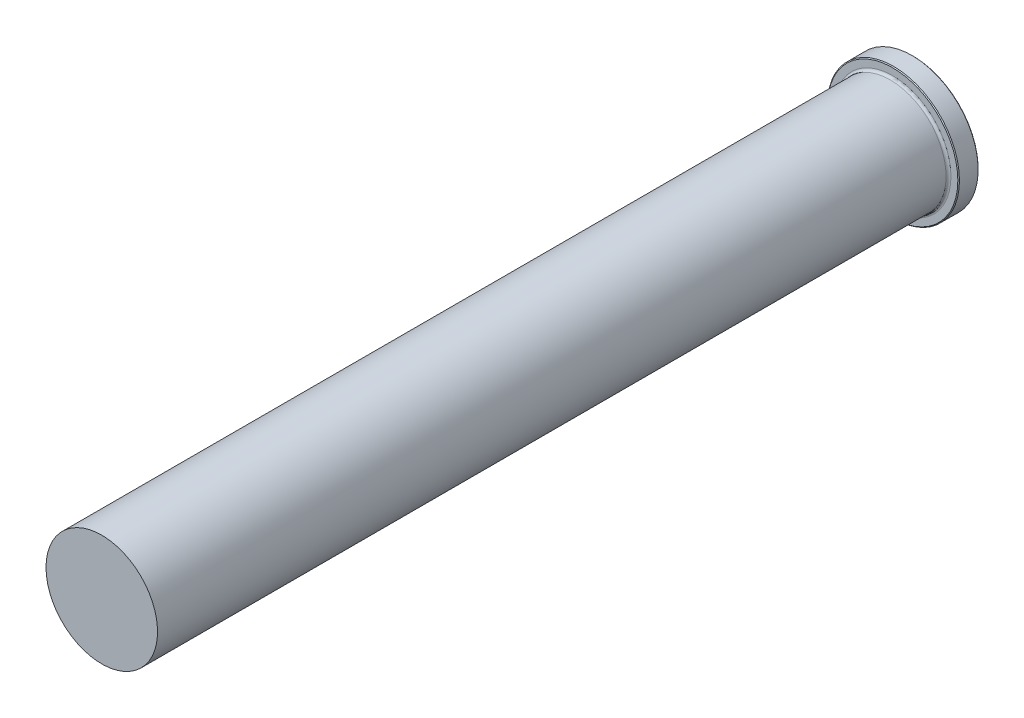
ISO-10303-21;
HEADER;
FILE_DESCRIPTION(('STEP AP214'),'2;1');
FILE_NAME('part.step','',(''),(''),'','','');
FILE_SCHEMA(('AUTOMOTIVE_DESIGN { 1 0 10303 214 1 1 1 1 }'));
ENDSEC;
DATA;
#1=APPLICATION_CONTEXT('core data for automotive mechanical design processes');
#2=APPLICATION_PROTOCOL_DEFINITION('international standard','automotive_design',2000,#1);
#3=PRODUCT_CONTEXT('',#1,'mechanical');
#4=PRODUCT('Part','Part','',(#3));
#5=PRODUCT_RELATED_PRODUCT_CATEGORY('part','',(#4));
#6=PRODUCT_DEFINITION_FORMATION('','',#4);
#7=PRODUCT_DEFINITION_CONTEXT('part definition',#1,'design');
#8=PRODUCT_DEFINITION('design','',#6,#7);
#9=PRODUCT_DEFINITION_SHAPE('','',#8);
#10=(LENGTH_UNIT() NAMED_UNIT(*) SI_UNIT(.MILLI.,.METRE.));
#11=(NAMED_UNIT(*) PLANE_ANGLE_UNIT() SI_UNIT($,.RADIAN.));
#12=(NAMED_UNIT(*) SI_UNIT($,.STERADIAN.) SOLID_ANGLE_UNIT());
#13=UNCERTAINTY_MEASURE_WITH_UNIT(LENGTH_MEASURE(1.E-05),#10,'distance_accuracy_value','');
#14=(GEOMETRIC_REPRESENTATION_CONTEXT(3) GLOBAL_UNCERTAINTY_ASSIGNED_CONTEXT((#13)) GLOBAL_UNIT_ASSIGNED_CONTEXT((#10,
#11,#12)) REPRESENTATION_CONTEXT('',''));
#15=CARTESIAN_POINT('',(0.,0.,0.));
#16=DIRECTION('',(0.,0.,1.));
#17=DIRECTION('',(1.,0.,0.));
#18=AXIS2_PLACEMENT_3D('',#15,#16,#17);
#19=CARTESIAN_POINT('',(0.,0.,0.));
#20=DIRECTION('',(0.,0.,-1.));
#21=DIRECTION('',(-1.,0.,0.));
#22=AXIS2_PLACEMENT_3D('',#19,#20,#21);
#23=PLANE('',#22);
#24=CARTESIAN_POINT('',(0.,0.,0.));
#25=DIRECTION('',(0.,0.,-1.));
#26=DIRECTION('',(-1.,0.,0.));
#27=AXIS2_PLACEMENT_3D('',#24,#25,#26);
#28=CIRCLE('',#27,20.3835);
#29=CARTESIAN_POINT('',(-20.3835,0.,0.));
#30=VERTEX_POINT('',#29);
#31=EDGE_CURVE('E50',#30,#30,#28,.T.);
#32=ORIENTED_EDGE('',*,*,#31,.T.);
#33=EDGE_LOOP('',(#32));
#34=FACE_BOUND('',#33,.T.);
#35=ADVANCED_FACE('F35',(#34),#23,.T.);
#36=CARTESIAN_POINT('',(0.,0.,0.));
#37=DIRECTION('',(0.,0.,-1.));
#38=DIRECTION('',(-1.,0.,0.));
#39=AXIS2_PLACEMENT_3D('',#36,#37,#38);
#40=CYLINDRICAL_SURFACE('',#39,20.6375);
#41=CARTESIAN_POINT('',(0.,0.,0.254000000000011));
#42=DIRECTION('',(0.,0.,-1.));
#43=DIRECTION('',(-1.,0.,0.));
#44=AXIS2_PLACEMENT_3D('',#41,#42,#43);
#45=CIRCLE('',#44,20.6375);
#46=CARTESIAN_POINT('',(-20.6375,0.,0.254000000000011));
#47=VERTEX_POINT('',#46);
#48=EDGE_CURVE('E42',#47,#47,#45,.F.);
#49=ORIENTED_EDGE('',*,*,#48,.T.);
#50=EDGE_LOOP('',(#49));
#51=FACE_BOUND('',#50,.T.);
#52=CARTESIAN_POINT('',(0.,0.,6.09600000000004));
#53=DIRECTION('',(0.,0.,1.));
#54=DIRECTION('',(1.,0.,0.));
#55=AXIS2_PLACEMENT_3D('',#52,#53,#54);
#56=CIRCLE('',#55,20.6375);
#57=CARTESIAN_POINT('',(20.6375,0.,6.09600000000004));
#58=VERTEX_POINT('',#57);
#59=EDGE_CURVE('E46',#58,#58,#56,.F.);
#60=ORIENTED_EDGE('',*,*,#59,.T.);
#61=EDGE_LOOP('',(#60));
#62=FACE_BOUND('',#61,.T.);
#63=ADVANCED_FACE('F82',(#51,#62),#40,.T.);
#64=CARTESIAN_POINT('',(0.,20.6375,6.35));
#65=DIRECTION('',(0.,0.,1.));
#66=DIRECTION('',(1.,0.,0.));
#67=AXIS2_PLACEMENT_3D('',#64,#65,#66);
#68=PLANE('',#67);
#69=CARTESIAN_POINT('',(0.,0.,6.35));
#70=DIRECTION('',(0.,0.,1.));
#71=DIRECTION('',(1.,0.,0.));
#72=AXIS2_PLACEMENT_3D('',#69,#70,#71);
#73=CIRCLE('',#72,20.3835);
#74=CARTESIAN_POINT('',(20.3835,0.,6.35));
#75=VERTEX_POINT('',#74);
#76=EDGE_CURVE('E10',#75,#75,#73,.T.);
#77=ORIENTED_EDGE('',*,*,#76,.T.);
#78=EDGE_LOOP('',(#77));
#79=FACE_BOUND('',#78,.T.);
#80=CARTESIAN_POINT('',(0.,0.,6.35));
#81=DIRECTION('',(0.,0.,1.));
#82=DIRECTION('',(1.,0.,0.));
#83=AXIS2_PLACEMENT_3D('',#80,#81,#82);
#84=CIRCLE('',#83,18.2245);
#85=CARTESIAN_POINT('',(18.2245,0.,6.35));
#86=VERTEX_POINT('',#85);
#87=EDGE_CURVE('E58',#86,#86,#84,.F.);
#88=ORIENTED_EDGE('',*,*,#87,.T.);
#89=EDGE_LOOP('',(#88));
#90=FACE_BOUND('',#89,.T.);
#91=ADVANCED_FACE('F78',(#79,#90),#68,.T.);
#92=CARTESIAN_POINT('',(0.,0.,0.));
#93=DIRECTION('',(0.,0.,-1.));
#94=DIRECTION('',(-1.,0.,0.));
#95=AXIS2_PLACEMENT_3D('',#92,#93,#94);
#96=CYLINDRICAL_SURFACE('',#95,17.4625);
#97=CARTESIAN_POINT('',(0.,0.,7.112));
#98=DIRECTION('',(0.,0.,1.));
#99=DIRECTION('',(1.,0.,0.));
#100=AXIS2_PLACEMENT_3D('',#97,#98,#99);
#101=CIRCLE('',#100,17.4625);
#102=CARTESIAN_POINT('',(17.4625,0.,7.112));
#103=VERTEX_POINT('',#102);
#104=EDGE_CURVE('E55',#103,#103,#101,.T.);
#105=ORIENTED_EDGE('',*,*,#104,.T.);
#106=EDGE_LOOP('',(#105));
#107=FACE_BOUND('',#106,.T.);
#108=CARTESIAN_POINT('',(0.,0.,254.));
#109=DIRECTION('',(0.,0.,-1.));
#110=DIRECTION('',(-1.,0.,0.));
#111=AXIS2_PLACEMENT_3D('',#108,#109,#110);
#112=CIRCLE('',#111,17.4625);
#113=CARTESIAN_POINT('',(-17.4625,0.,254.));
#114=VERTEX_POINT('',#113);
#115=EDGE_CURVE('E61',#114,#114,#112,.T.);
#116=ORIENTED_EDGE('',*,*,#115,.T.);
#117=EDGE_LOOP('',(#116));
#118=FACE_BOUND('',#117,.T.);
#119=ADVANCED_FACE('F65',(#107,#118),#96,.T.);
#120=CARTESIAN_POINT('',(0.,17.4625,254.));
#121=DIRECTION('',(0.,0.,1.));
#122=DIRECTION('',(1.,0.,0.));
#123=AXIS2_PLACEMENT_3D('',#120,#121,#122);
#124=PLANE('',#123);
#125=ORIENTED_EDGE('',*,*,#115,.F.);
#126=EDGE_LOOP('',(#125));
#127=FACE_BOUND('',#126,.T.);
#128=ADVANCED_FACE('F67',(#127),#124,.T.);
#129=CARTESIAN_POINT('',(0.,0.,7.112));
#130=DIRECTION('',(0.,0.,1.));
#131=DIRECTION('',(1.,0.,0.));
#132=AXIS2_PLACEMENT_3D('',#129,#130,#131);
#133=TOROIDAL_SURFACE('',#132,18.2245,0.762);
#134=ORIENTED_EDGE('',*,*,#104,.F.);
#135=EDGE_LOOP('',(#134));
#136=FACE_BOUND('',#135,.T.);
#137=ORIENTED_EDGE('',*,*,#87,.F.);
#138=EDGE_LOOP('',(#137));
#139=FACE_BOUND('',#138,.T.);
#140=ADVANCED_FACE('F69',(#136,#139),#133,.F.);
#141=CARTESIAN_POINT('',(0.,0.,0.));
#142=DIRECTION('',(0.,0.,1.));
#143=DIRECTION('',(1.,0.,0.));
#144=AXIS2_PLACEMENT_3D('',#141,#142,#143);
#145=CONICAL_SURFACE('',#144,20.3835,0.785398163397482);
#146=ORIENTED_EDGE('',*,*,#48,.F.);
#147=EDGE_LOOP('',(#146));
#148=FACE_BOUND('',#147,.T.);
#149=ORIENTED_EDGE('',*,*,#31,.F.);
#150=EDGE_LOOP('',(#149));
#151=FACE_BOUND('',#150,.T.);
#152=ADVANCED_FACE('F75',(#148,#151),#145,.T.);
#153=CARTESIAN_POINT('',(0.,0.,6.09600000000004));
#154=DIRECTION('',(0.,0.,-1.));
#155=DIRECTION('',(-1.,0.,0.));
#156=AXIS2_PLACEMENT_3D('',#153,#154,#155);
#157=CONICAL_SURFACE('',#156,20.6375,0.785398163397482);
#158=ORIENTED_EDGE('',*,*,#76,.F.);
#159=EDGE_LOOP('',(#158));
#160=FACE_BOUND('',#159,.T.);
#161=ORIENTED_EDGE('',*,*,#59,.F.);
#162=EDGE_LOOP('',(#161));
#163=FACE_BOUND('',#162,.T.);
#164=ADVANCED_FACE('F37',(#160,#163),#157,.T.);
#165=CLOSED_SHELL('',(#35,#63,#91,#119,#128,#140,#152,#164));
#166=MANIFOLD_SOLID_BREP('B2',#165);
#167=ADVANCED_BREP_SHAPE_REPRESENTATION('',(#18,#166),#14);
#168=SHAPE_DEFINITION_REPRESENTATION(#9,#167);
ENDSEC;
END-ISO-10303-21;
